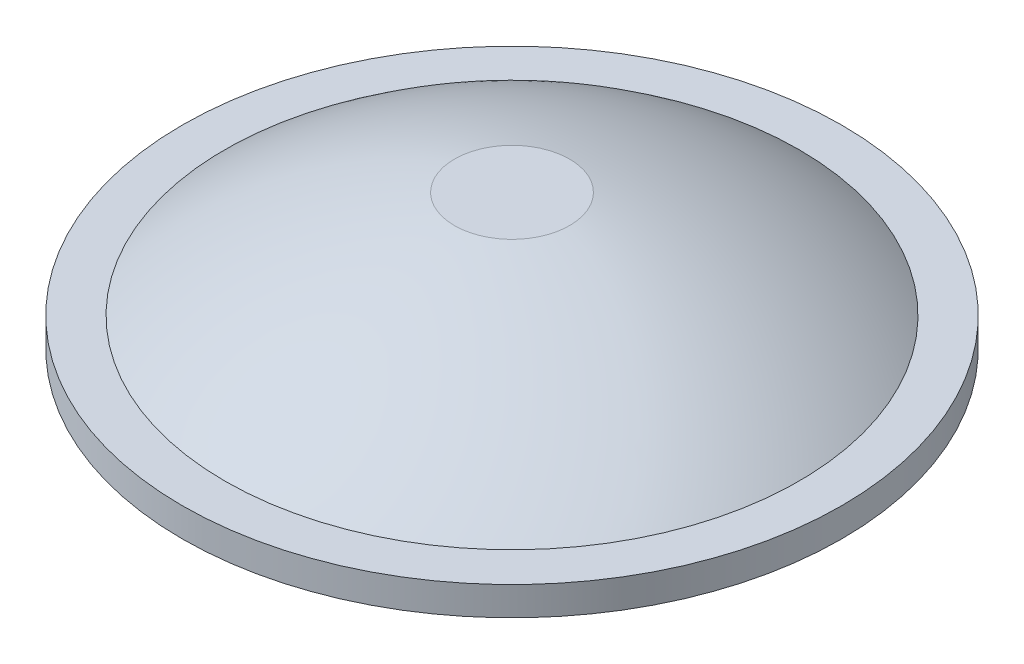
from build123d import *

# Parameters (mm, degrees)
CUT_EXTRUDE1_REACH = 108.226
SKETCH2_R          = 5.5499


with BuildPart() as part:
    # Sketch1 → Base-Revolve (revolve)
    with BuildSketch(Plane.XY, mode=Mode.PRIVATE) as base_revolve_sk:
        with BuildLine():
            Line((0, 26.67), (0, 23.495))
            Line((0, 23.495), (-12.362589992, 23.495))
            ThreePointArc((-12.362589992, 23.495), (-38.630222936, 14.592576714), (-62.216201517, 0))
            ThreePointArc((-62.216201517, 0), (-38.630222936, -14.592576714), (-12.362589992, -23.495))
            Line((-12.362589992, -23.495), (0, -23.495))
            Line((0, -23.495), (0, -26.67))
            Line((0, -26.67), (-12.7, -26.67))
            ThreePointArc((-12.7, -26.67), (-39.327424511, -17.771612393), (-63.3095, -3.175))
            Line((-63.3095, -3.175), (-72.7075, -3.175))
            Line((-72.7075, -3.175), (-72.7075, 3.175))
            Line((-72.7075, 3.175), (-63.3095, 3.175))
            ThreePointArc((-63.3095, 3.175), (-39.327424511, 17.771612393), (-12.7, 26.67))
            Line((-12.7, 26.67), (0, 26.67))
        make_face()
    revolve(base_revolve_sk.sketch.rotate(Axis((0, 10.16, 0), (0, -1, 0)), 270), axis=Axis((0, 10.16, 0), (0, -1, 0)))

    # Sketch2 → Cut-Extrude1 (cut, up to next)
    with BuildSketch(Plane(origin=(0, 0, 0), x_dir=(1, 0, 0), z_dir=(0, 1, 0)), mode=Mode.PRIVATE) as cut_extrude1_sk1:
        with Locations(Location((0, 0, 0), (0, 0, 270))):
            Circle(SKETCH2_R)
    cut_extrude1_tool1 = extrude(cut_extrude1_sk1.sketch, amount=-CUT_EXTRUDE1_REACH, mode=Mode.PRIVATE) & part.part
    add(cut_extrude1_tool1.solids().sort_by_distance((0, 0, 0))[0], mode=Mode.SUBTRACT)


solid = part.part
